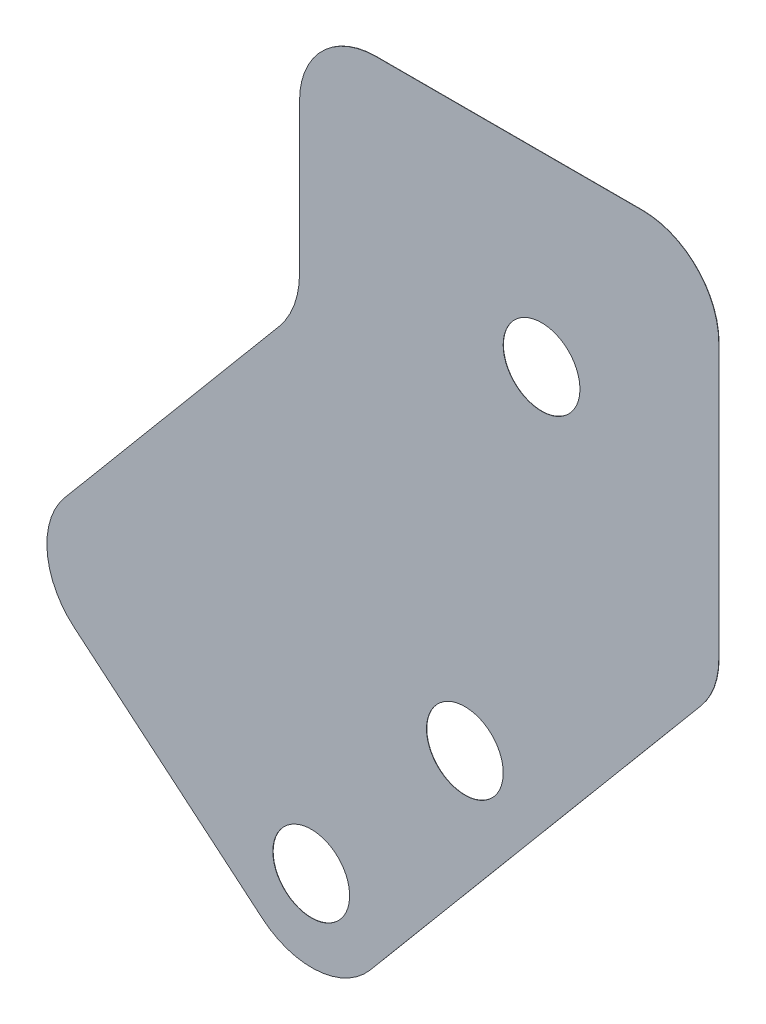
from build123d import *

# Parameters (mm, degrees)
BOSS_EXTRUDE1_DEPTH = 0.0254
HOLE1_D             = 7.1374


with BuildPart() as part:
    # Sketch1 → Boss-Extrude1 (new body)
    with BuildSketch(Plane.XY):
        with BuildLine():
            Line((-552.951152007, -13.707872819), (-577.716152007, -13.707872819))
            ThreePointArc((-577.716152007, -13.707872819), (-582.745095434, -15.790929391), (-584.828152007, -20.819872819))
            Line((-584.828152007, -20.819872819), (-584.828152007, -34.722664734))
            ThreePointArc((-584.828152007, -34.722664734), (-585.318330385, -37.502604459), (-586.729742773, -39.947242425))
            Line((-586.729742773, -39.947242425), (-606.659260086, -63.698316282))
            ThreePointArc((-606.659260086, -63.698316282), (-608.296088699, -68.889673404), (-605.782657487, -73.717929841))
            Line((-605.782657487, -73.717929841), (-588.270881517, -88.412054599))
            ThreePointArc((-588.270881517, -88.412054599), (-583.079524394, -90.048883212), (-578.251267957, -87.535452))
            Line((-578.251267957, -87.535452), (-547.503043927, -50.891145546))
            ThreePointArc((-547.503043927, -50.891145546), (-546.268058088, -48.752087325), (-545.839152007, -46.319640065))
            Line((-545.839152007, -46.319640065), (-545.839152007, -20.819872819))
            ThreePointArc((-545.839152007, -20.819872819), (-547.922208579, -15.790929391), (-552.951152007, -13.707872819))
        make_face()
    extrude(amount=BOSS_EXTRUDE1_DEPTH)

    # Hole1 (through all)
    with Locations(Plane(origin=(-580.067928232, -71.915501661, 0), x_dir=(-1, 0, 0), z_dir=(0, 0, -1))):
        with Locations((3.670581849, -10.601140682), (-17.744132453, 40.906909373), (-10.615372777, 6.424197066)):
            Hole(HOLE1_D / 2)


solid = part.part
